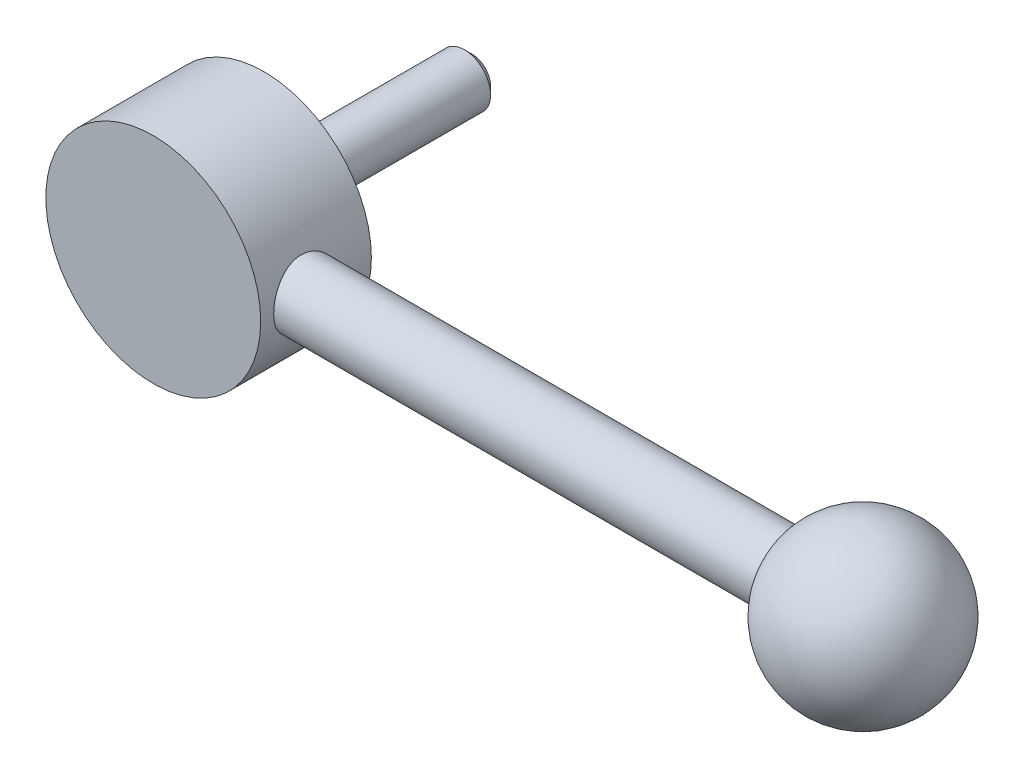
ISO-10303-21;
HEADER;
FILE_DESCRIPTION(('STEP AP214'),'2;1');
FILE_NAME('part.step','',(''),(''),'','','');
FILE_SCHEMA(('AUTOMOTIVE_DESIGN { 1 0 10303 214 1 1 1 1 }'));
ENDSEC;
DATA;
#1=APPLICATION_CONTEXT('core data for automotive mechanical design processes');
#2=APPLICATION_PROTOCOL_DEFINITION('international standard','automotive_design',2000,#1);
#3=PRODUCT_CONTEXT('',#1,'mechanical');
#4=PRODUCT('Part','Part','',(#3));
#5=PRODUCT_RELATED_PRODUCT_CATEGORY('part','',(#4));
#6=PRODUCT_DEFINITION_FORMATION('','',#4);
#7=PRODUCT_DEFINITION_CONTEXT('part definition',#1,'design');
#8=PRODUCT_DEFINITION('design','',#6,#7);
#9=PRODUCT_DEFINITION_SHAPE('','',#8);
#10=(LENGTH_UNIT() NAMED_UNIT(*) SI_UNIT(.MILLI.,.METRE.));
#11=(NAMED_UNIT(*) PLANE_ANGLE_UNIT() SI_UNIT($,.RADIAN.));
#12=(NAMED_UNIT(*) SI_UNIT($,.STERADIAN.) SOLID_ANGLE_UNIT());
#13=UNCERTAINTY_MEASURE_WITH_UNIT(LENGTH_MEASURE(1.E-05),#10,'distance_accuracy_value','');
#14=(GEOMETRIC_REPRESENTATION_CONTEXT(3) GLOBAL_UNCERTAINTY_ASSIGNED_CONTEXT((#13)) GLOBAL_UNIT_ASSIGNED_CONTEXT((#10,
#11,#12)) REPRESENTATION_CONTEXT('',''));
#15=CARTESIAN_POINT('',(0.,0.,0.));
#16=DIRECTION('',(0.,0.,1.));
#17=DIRECTION('',(1.,0.,0.));
#18=AXIS2_PLACEMENT_3D('',#15,#16,#17);
#19=CARTESIAN_POINT('',(0.,0.,40.));
#20=DIRECTION('',(0.,0.,1.));
#21=DIRECTION('',(1.,0.,0.));
#22=AXIS2_PLACEMENT_3D('',#19,#20,#21);
#23=CYLINDRICAL_SURFACE('',#22,6.75);
#24=CARTESIAN_POINT('',(0.,0.,2.));
#25=DIRECTION('',(0.,0.,1.));
#26=DIRECTION('',(1.,0.,0.));
#27=AXIS2_PLACEMENT_3D('',#24,#25,#26);
#28=CIRCLE('',#27,6.75);
#29=CARTESIAN_POINT('',(6.75,0.,2.));
#30=VERTEX_POINT('',#29);
#31=EDGE_CURVE('E23',#30,#30,#28,.T.);
#32=ORIENTED_EDGE('',*,*,#31,.F.);
#33=EDGE_LOOP('',(#32));
#34=FACE_BOUND('',#33,.T.);
#35=CARTESIAN_POINT('',(0.,0.,0.));
#36=DIRECTION('',(0.,0.,1.));
#37=DIRECTION('',(1.,0.,0.));
#38=AXIS2_PLACEMENT_3D('',#35,#36,#37);
#39=CIRCLE('',#38,6.75);
#40=CARTESIAN_POINT('',(6.75,0.,0.));
#41=VERTEX_POINT('',#40);
#42=EDGE_CURVE('E37',#41,#41,#39,.T.);
#43=ORIENTED_EDGE('',*,*,#42,.T.);
#44=EDGE_LOOP('',(#43));
#45=FACE_BOUND('',#44,.T.);
#46=ADVANCED_FACE('F12',(#34,#45),#23,.T.);
#47=CARTESIAN_POINT('',(6.75,0.,2.));
#48=DIRECTION('',(0.,0.,1.));
#49=DIRECTION('',(1.,0.,0.));
#50=AXIS2_PLACEMENT_3D('',#47,#48,#49);
#51=PLANE('',#50);
#52=CARTESIAN_POINT('',(0.,0.,2.));
#53=DIRECTION('',(0.,0.,1.));
#54=DIRECTION('',(1.,0.,0.));
#55=AXIS2_PLACEMENT_3D('',#52,#53,#54);
#56=CIRCLE('',#55,16.5);
#57=CARTESIAN_POINT('',(16.5,0.,2.));
#58=VERTEX_POINT('',#57);
#59=EDGE_CURVE('E27',#58,#58,#56,.T.);
#60=ORIENTED_EDGE('',*,*,#59,.F.);
#61=EDGE_LOOP('',(#60));
#62=FACE_BOUND('',#61,.T.);
#63=ORIENTED_EDGE('',*,*,#31,.T.);
#64=EDGE_LOOP('',(#63));
#65=FACE_BOUND('',#64,.T.);
#66=ADVANCED_FACE('F68',(#62,#65),#51,.F.);
#67=CARTESIAN_POINT('',(0.,0.,40.));
#68=DIRECTION('',(0.,0.,1.));
#69=DIRECTION('',(1.,0.,0.));
#70=AXIS2_PLACEMENT_3D('',#67,#68,#69);
#71=CYLINDRICAL_SURFACE('',#70,16.5);
#72=CARTESIAN_POINT('',(16.5,0.,7.));
#73=CARTESIAN_POINT('',(16.499997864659,-0.27416656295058,7.00000297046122));
#74=CARTESIAN_POINT('',(16.493101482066,-0.548363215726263,7.02262484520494));
#75=CARTESIAN_POINT('',(16.4662646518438,-1.08876356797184,7.11229452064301));
#76=CARTESIAN_POINT('',(16.446320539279,-1.35496499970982,7.17935480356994));
#77=CARTESIAN_POINT('',(16.3955720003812,-1.87150278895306,7.35545075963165));
#78=CARTESIAN_POINT('',(16.3647837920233,-2.12186218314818,7.4644237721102));
#79=CARTESIAN_POINT('',(16.2955420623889,-2.60075521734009,7.72099257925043));
#80=CARTESIAN_POINT('',(16.2570874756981,-2.82928581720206,7.86859374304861));
#81=CARTESIAN_POINT('',(16.1753529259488,-3.26471495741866,8.20277426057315));
#82=CARTESIAN_POINT('',(16.1319725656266,-3.47088543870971,8.39027763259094));
#83=CARTESIAN_POINT('',(16.0458704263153,-3.84938917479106,8.79697111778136));
#84=CARTESIAN_POINT('',(16.003148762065,-4.02171659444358,9.0161666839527));
#85=CARTESIAN_POINT('',(15.9221353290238,-4.33150150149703,9.48621682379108));
#86=CARTESIAN_POINT('',(15.8839681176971,-4.46806535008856,9.73768383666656));
#87=CARTESIAN_POINT('',(15.8178878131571,-4.69666762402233,10.2613575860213));
#88=CARTESIAN_POINT('',(15.7899722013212,-4.78871698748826,10.5335592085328));
#89=CARTESIAN_POINT('',(15.748602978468,-4.92304273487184,11.0827901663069));
#90=CARTESIAN_POINT('',(15.7347597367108,-4.96666335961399,11.3594605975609));
#91=CARTESIAN_POINT('',(15.7219440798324,-5.00709144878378,11.9165124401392));
#92=CARTESIAN_POINT('',(15.7229679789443,-5.00391051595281,12.1968929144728));
#93=CARTESIAN_POINT('',(15.7394259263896,-4.95188056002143,12.7424297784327));
#94=CARTESIAN_POINT('',(15.7543266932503,-4.90472150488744,13.0077661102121));
#95=CARTESIAN_POINT('',(15.7959958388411,-4.76880670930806,13.5265684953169));
#96=CARTESIAN_POINT('',(15.8227654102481,-4.68004678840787,13.7800333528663));
#97=CARTESIAN_POINT('',(15.8855774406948,-4.46221737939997,14.2720056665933));
#98=CARTESIAN_POINT('',(15.9217437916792,-4.33260397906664,14.5102558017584));
#99=CARTESIAN_POINT('',(15.9992154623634,-4.03712482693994,14.9621878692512));
#100=CARTESIAN_POINT('',(16.0405220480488,-3.87125013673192,15.1758637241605));
#101=CARTESIAN_POINT('',(16.125777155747,-3.49958783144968,15.5821595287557));
#102=CARTESIAN_POINT('',(16.1697632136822,-3.29239951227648,15.7734925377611));
#103=CARTESIAN_POINT('',(16.2538615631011,-2.84832978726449,16.1190003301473));
#104=CARTESIAN_POINT('',(16.2939736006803,-2.61144643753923,16.2731726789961));
#105=CARTESIAN_POINT('',(16.3661834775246,-2.11233821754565,16.540785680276));
#106=CARTESIAN_POINT('',(16.3982236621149,-1.84994861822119,16.6539357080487));
#107=CARTESIAN_POINT('',(16.4502641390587,-1.30866646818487,16.8341173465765));
#108=CARTESIAN_POINT('',(16.4702678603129,-1.02977864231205,16.9011620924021));
#109=CARTESIAN_POINT('',(16.4954369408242,-0.474353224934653,16.985075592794));
#110=CARTESIAN_POINT('',(16.5011177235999,-0.198102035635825,17.0036880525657));
#111=CARTESIAN_POINT('',(16.4985159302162,0.353597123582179,16.99510293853));
#112=CARTESIAN_POINT('',(16.4902352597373,0.629045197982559,16.9679116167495));
#113=CARTESIAN_POINT('',(16.4609787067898,1.16470330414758,16.869898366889));
#114=CARTESIAN_POINT('',(16.4403007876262,1.42511840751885,16.8000997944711));
#115=CARTESIAN_POINT('',(16.388649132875,1.93048096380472,16.6200887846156));
#116=CARTESIAN_POINT('',(16.3576741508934,2.17542653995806,16.5098714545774));
#117=CARTESIAN_POINT('',(16.2877277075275,2.64927766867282,16.2492534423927));
#118=CARTESIAN_POINT('',(16.2485858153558,2.87767261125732,16.097971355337));
#119=CARTESIAN_POINT('',(16.1667951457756,3.30642612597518,15.7605859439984));
#120=CARTESIAN_POINT('',(16.1241454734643,3.50677750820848,15.5744737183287));
#121=CARTESIAN_POINT('',(16.0381606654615,3.88146430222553,15.1645160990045));
#122=CARTESIAN_POINT('',(15.9948588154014,4.05455854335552,14.9395268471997));
#123=CARTESIAN_POINT('',(15.9141467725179,4.36062787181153,14.4627539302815));
#124=CARTESIAN_POINT('',(15.8767364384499,4.49360392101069,14.2109709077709));
#125=CARTESIAN_POINT('',(15.8124706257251,4.71477026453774,13.6884965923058));
#126=CARTESIAN_POINT('',(15.7855679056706,4.80316154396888,13.4178965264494));
#127=CARTESIAN_POINT('',(15.7455304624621,4.93284562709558,12.8646819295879));
#128=CARTESIAN_POINT('',(15.732390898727,4.97415499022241,12.5820716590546));
#129=CARTESIAN_POINT('',(15.7218509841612,5.00736143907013,12.0257720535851));
#130=CARTESIAN_POINT('',(15.7238051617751,5.00128483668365,11.7522143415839));
#131=CARTESIAN_POINT('',(15.7416767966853,4.94474176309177,11.2102140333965));
#132=CARTESIAN_POINT('',(15.7575936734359,4.89427713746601,10.9417712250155));
#133=CARTESIAN_POINT('',(15.8011599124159,4.75171037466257,10.4210074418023));
#134=CARTESIAN_POINT('',(15.8286548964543,4.66015510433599,10.1685228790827));
#135=CARTESIAN_POINT('',(15.8922482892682,4.43843275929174,9.68229661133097));
#136=CARTESIAN_POINT('',(15.9283483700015,4.30825817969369,9.44855856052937));
#137=CARTESIAN_POINT('',(16.0067548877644,4.00734203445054,8.99708364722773));
#138=CARTESIAN_POINT('',(16.0492418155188,3.83527527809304,8.78026142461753));
#139=CARTESIAN_POINT('',(16.1347696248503,3.45783157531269,8.3779118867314));
#140=CARTESIAN_POINT('',(16.1778106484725,3.25244592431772,8.19239277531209));
#141=CARTESIAN_POINT('',(16.2611473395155,2.80676565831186,7.85235596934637));
#142=CARTESIAN_POINT('',(16.301321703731,2.56560775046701,7.69893691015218));
#143=CARTESIAN_POINT('',(16.3729264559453,2.05970384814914,7.43503282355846));
#144=CARTESIAN_POINT('',(16.4043607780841,1.79496853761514,7.32452847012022));
#145=CARTESIAN_POINT('',(16.4523310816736,1.27725626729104,7.15905013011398));
#146=CARTESIAN_POINT('',(16.4700574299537,1.02582323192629,7.09957036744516));
#147=CARTESIAN_POINT('',(16.4938918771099,0.516268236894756,7.02004735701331));
#148=CARTESIAN_POINT('',(16.5000020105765,0.258147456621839,6.999997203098));
#149=CARTESIAN_POINT('',(16.5,0.,7.));
#150=B_SPLINE_CURVE_WITH_KNOTS('',3,(#72,#73,#74,#75,#76,#77,#78,#79,#80,#81,#82,#83,#84,#85,
#86,#87,#88,#89,#90,#91,#92,#93,#94,#95,#96,#97,#98,#99,#100,#101,#102,#103,#104,#105,#106,#107,
#108,#109,#110,#111,#112,#113,#114,#115,#116,#117,#118,#119,#120,#121,#122,#123,#124,#125,#126,
#127,#128,#129,#130,#131,#132,#133,#134,#135,#136,#137,#138,#139,#140,#141,#142,#143,#144,#145,
#146,#147,#148,#149),.UNSPECIFIED.,.T.,.F.,(4,2,2,2,2,2,2,2,2,2,2,2,2,2,2,2,2,2,2,2,2,2,2,2,2,2,
2,2,2,2,2,2,2,2,2,2,2,2,4),(0.,0.82155130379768,1.64333346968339,2.46389179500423,
3.28456423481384,4.12684629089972,4.96927344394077,5.83108565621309,6.69268599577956,
7.52972147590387,8.36654944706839,9.1724896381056,9.97851083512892,10.7957518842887,
11.6131946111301,12.4655059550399,13.3178731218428,14.1761660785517,15.0342144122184,
15.8609136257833,16.6875000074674,17.49497421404,18.302546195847,19.1290491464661,
19.9557636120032,20.8131534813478,21.6705227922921,22.5239918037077,23.3771605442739,
24.194052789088,25.0109110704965,25.8172062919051,26.6236583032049,27.4600121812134,
28.2965849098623,29.1582870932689,30.0196007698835,30.7932856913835,31.5668350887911),.UNSPECIFIED.);
#151=CARTESIAN_POINT('',(16.5,0.,7.));
#152=VERTEX_POINT('',#151);
#153=EDGE_CURVE('E30',#152,#152,#150,.T.);
#154=ORIENTED_EDGE('',*,*,#153,.T.);
#155=EDGE_LOOP('',(#154));
#156=FACE_BOUND('',#155,.T.);
#157=CARTESIAN_POINT('',(0.,0.,19.));
#158=DIRECTION('',(0.,0.,1.));
#159=DIRECTION('',(1.,0.,0.));
#160=AXIS2_PLACEMENT_3D('',#157,#158,#159);
#161=CIRCLE('',#160,16.5);
#162=CARTESIAN_POINT('',(16.5,0.,19.));
#163=VERTEX_POINT('',#162);
#164=EDGE_CURVE('E85',#163,#163,#161,.T.);
#165=ORIENTED_EDGE('',*,*,#164,.F.);
#166=EDGE_LOOP('',(#165));
#167=FACE_BOUND('',#166,.T.);
#168=ORIENTED_EDGE('',*,*,#59,.T.);
#169=EDGE_LOOP('',(#168));
#170=FACE_BOUND('',#169,.T.);
#171=ADVANCED_FACE('F40',(#156,#167,#170),#71,.T.);
#172=CARTESIAN_POINT('',(16.5,0.,19.));
#173=DIRECTION('',(0.,0.,-1.));
#174=DIRECTION('',(-1.,0.,0.));
#175=AXIS2_PLACEMENT_3D('',#172,#173,#174);
#176=PLANE('',#175);
#177=ORIENTED_EDGE('',*,*,#164,.T.);
#178=EDGE_LOOP('',(#177));
#179=FACE_BOUND('',#178,.T.);
#180=ADVANCED_FACE('F60',(#179),#176,.F.);
#181=CARTESIAN_POINT('',(4.,0.,-30.));
#182=DIRECTION('',(0.,0.,-1.));
#183=DIRECTION('',(-1.,0.,0.));
#184=AXIS2_PLACEMENT_3D('',#181,#182,#183);
#185=PLANE('',#184);
#186=CARTESIAN_POINT('',(0.,0.,-30.));
#187=DIRECTION('',(0.,0.,-1.));
#188=DIRECTION('',(-1.,0.,0.));
#189=AXIS2_PLACEMENT_3D('',#186,#187,#188);
#190=CIRCLE('',#189,2.8);
#191=CARTESIAN_POINT('',(-2.8,0.,-30.));
#192=VERTEX_POINT('',#191);
#193=EDGE_CURVE('E8',#192,#192,#190,.T.);
#194=ORIENTED_EDGE('',*,*,#193,.T.);
#195=EDGE_LOOP('',(#194));
#196=FACE_BOUND('',#195,.T.);
#197=ADVANCED_FACE('F58',(#196),#185,.T.);
#198=CARTESIAN_POINT('',(0.,0.,40.));
#199=DIRECTION('',(0.,0.,1.));
#200=DIRECTION('',(1.,0.,0.));
#201=AXIS2_PLACEMENT_3D('',#198,#199,#200);
#202=CYLINDRICAL_SURFACE('',#201,4.);
#203=CARTESIAN_POINT('',(0.,0.,-28.8));
#204=DIRECTION('',(0.,0.,-1.));
#205=DIRECTION('',(-1.,0.,0.));
#206=AXIS2_PLACEMENT_3D('',#203,#204,#205);
#207=CIRCLE('',#206,4.);
#208=CARTESIAN_POINT('',(-4.,0.,-28.8));
#209=VERTEX_POINT('',#208);
#210=EDGE_CURVE('E19',#209,#209,#207,.F.);
#211=ORIENTED_EDGE('',*,*,#210,.T.);
#212=EDGE_LOOP('',(#211));
#213=FACE_BOUND('',#212,.T.);
#214=CARTESIAN_POINT('',(0.,0.,0.));
#215=DIRECTION('',(0.,0.,1.));
#216=DIRECTION('',(1.,0.,0.));
#217=AXIS2_PLACEMENT_3D('',#214,#215,#216);
#218=CIRCLE('',#217,4.);
#219=CARTESIAN_POINT('',(4.,0.,0.));
#220=VERTEX_POINT('',#219);
#221=EDGE_CURVE('E82',#220,#220,#218,.T.);
#222=ORIENTED_EDGE('',*,*,#221,.F.);
#223=EDGE_LOOP('',(#222));
#224=FACE_BOUND('',#223,.T.);
#225=ADVANCED_FACE('F54',(#213,#224),#202,.T.);
#226=CARTESIAN_POINT('',(4.,0.,0.));
#227=DIRECTION('',(0.,0.,1.));
#228=DIRECTION('',(1.,0.,0.));
#229=AXIS2_PLACEMENT_3D('',#226,#227,#228);
#230=PLANE('',#229);
#231=ORIENTED_EDGE('',*,*,#42,.F.);
#232=EDGE_LOOP('',(#231));
#233=FACE_BOUND('',#232,.T.);
#234=ORIENTED_EDGE('',*,*,#221,.T.);
#235=EDGE_LOOP('',(#234));
#236=FACE_BOUND('',#235,.T.);
#237=ADVANCED_FACE('F50',(#233,#236),#230,.F.);
#238=CARTESIAN_POINT('',(-30.,0.,12.));
#239=DIRECTION('',(-1.,0.,0.));
#240=DIRECTION('',(0.,0.,1.));
#241=AXIS2_PLACEMENT_3D('',#238,#239,#240);
#242=CYLINDRICAL_SURFACE('',#241,5.);
#243=CARTESIAN_POINT('',(90.5435607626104,0.,12.));
#244=DIRECTION('',(-1.,0.,0.));
#245=DIRECTION('',(0.,0.,1.));
#246=AXIS2_PLACEMENT_3D('',#243,#244,#245);
#247=CIRCLE('',#246,5.);
#248=CARTESIAN_POINT('',(90.5435607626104,0.,17.));
#249=VERTEX_POINT('',#248);
#250=EDGE_CURVE('E38',#249,#249,#247,.T.);
#251=ORIENTED_EDGE('',*,*,#250,.T.);
#252=EDGE_LOOP('',(#251));
#253=FACE_BOUND('',#252,.T.);
#254=ORIENTED_EDGE('',*,*,#153,.F.);
#255=EDGE_LOOP('',(#254));
#256=FACE_BOUND('',#255,.T.);
#257=ADVANCED_FACE('F44',(#253,#256),#242,.T.);
#258=CARTESIAN_POINT('',(102.,0.,12.));
#259=DIRECTION('',(0.,0.,1.));
#260=DIRECTION('',(1.,0.,0.));
#261=AXIS2_PLACEMENT_3D('',#258,#259,#260);
#262=SPHERICAL_SURFACE('',#261,12.5);
#263=CARTESIAN_POINT('',(102.,0.,12.));
#264=DIRECTION('',(-1.,0.,0.));
#265=DIRECTION('',(0.,0.,1.));
#266=AXIS2_PLACEMENT_3D('',#263,#264,#265);
#267=SPHERICAL_SURFACE('',#266,12.5);
#268=ORIENTED_EDGE('',*,*,#250,.F.);
#269=EDGE_LOOP('',(#268));
#270=FACE_BOUND('',#269,.T.);
#271=ADVANCED_FACE('F49',(#270),#267,.T.);
#272=CARTESIAN_POINT('',(0.,0.,-28.8));
#273=DIRECTION('',(0.,0.,1.));
#274=DIRECTION('',(1.,0.,0.));
#275=AXIS2_PLACEMENT_3D('',#272,#273,#274);
#276=CONICAL_SURFACE('',#275,4.,0.785398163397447);
#277=ORIENTED_EDGE('',*,*,#193,.F.);
#278=EDGE_LOOP('',(#277));
#279=FACE_BOUND('',#278,.T.);
#280=ORIENTED_EDGE('',*,*,#210,.F.);
#281=EDGE_LOOP('',(#280));
#282=FACE_BOUND('',#281,.T.);
#283=ADVANCED_FACE('F14',(#279,#282),#276,.T.);
#284=CLOSED_SHELL('',(#46,#66,#171,#180,#197,#225,#237,#257,#271,#283));
#285=MANIFOLD_SOLID_BREP('B1',#284);
#286=ADVANCED_BREP_SHAPE_REPRESENTATION('',(#18,#285),#14);
#287=SHAPE_DEFINITION_REPRESENTATION(#9,#286);
ENDSEC;
END-ISO-10303-21;
